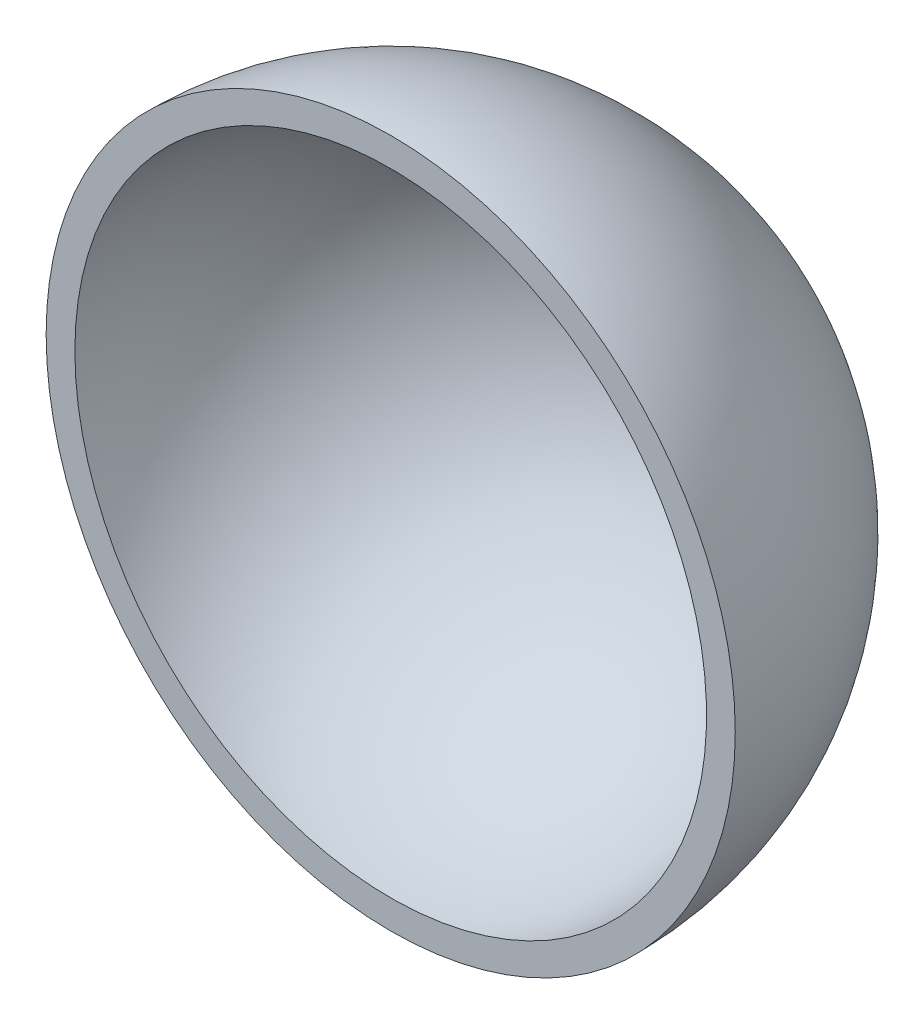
from build123d import *


with BuildPart() as part:
    # Esquisse1 → R_volution1 (revolve)
    with BuildSketch(Plane(origin=(0, 0, 0), x_dir=(1, 0, 0), z_dir=(0, 1, 0)), mode=Mode.PRIVATE) as r_volution1_sk:
        with BuildLine():
            Line((-24, 0), (-22, 0))
            ThreePointArc((-22, 0), (-15.556349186, 15.556349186), (0, 22))
            Line((0, 22), (0, 24))
            ThreePointArc((0, 24), (-16.970562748, 16.970562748), (-24, 0))
        make_face()
    revolve(r_volution1_sk.sketch.rotate(Axis((0, 0, -24), (0, 0, 1)), 180), axis=Axis((0, 0, -24), (0, 0, 1)))


solid = part.part
